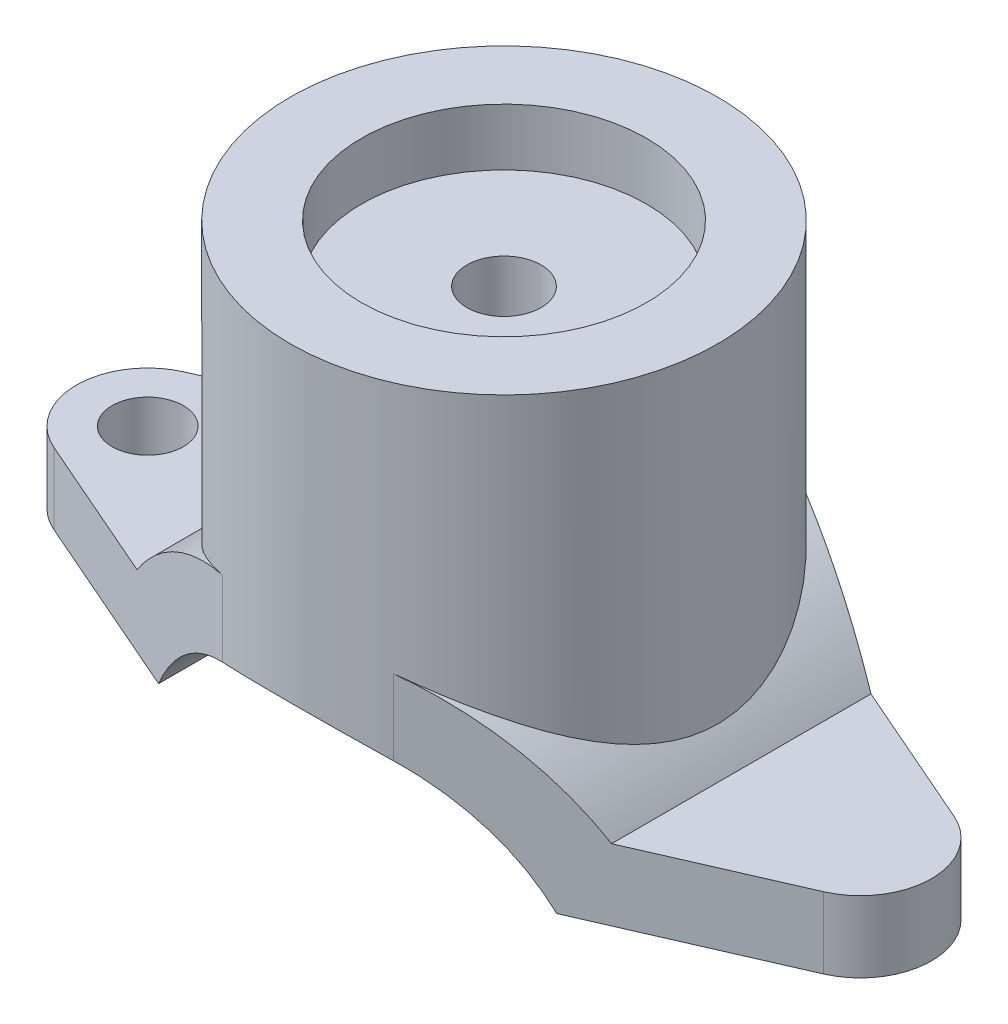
ISO-10303-21;
HEADER;
FILE_DESCRIPTION(('STEP AP214'),'2;1');
FILE_NAME('part.step','',(''),(''),'','','');
FILE_SCHEMA(('AUTOMOTIVE_DESIGN { 1 0 10303 214 1 1 1 1 }'));
ENDSEC;
DATA;
#1=APPLICATION_CONTEXT('core data for automotive mechanical design processes');
#2=APPLICATION_PROTOCOL_DEFINITION('international standard','automotive_design',2000,#1);
#3=PRODUCT_CONTEXT('',#1,'mechanical');
#4=PRODUCT('Part','Part','',(#3));
#5=PRODUCT_RELATED_PRODUCT_CATEGORY('part','',(#4));
#6=PRODUCT_DEFINITION_FORMATION('','',#4);
#7=PRODUCT_DEFINITION_CONTEXT('part definition',#1,'design');
#8=PRODUCT_DEFINITION('design','',#6,#7);
#9=PRODUCT_DEFINITION_SHAPE('','',#8);
#10=(LENGTH_UNIT() NAMED_UNIT(*) SI_UNIT(.MILLI.,.METRE.));
#11=(NAMED_UNIT(*) PLANE_ANGLE_UNIT() SI_UNIT($,.RADIAN.));
#12=(NAMED_UNIT(*) SI_UNIT($,.STERADIAN.) SOLID_ANGLE_UNIT());
#13=UNCERTAINTY_MEASURE_WITH_UNIT(LENGTH_MEASURE(1.E-05),#10,'distance_accuracy_value','');
#14=(GEOMETRIC_REPRESENTATION_CONTEXT(3) GLOBAL_UNCERTAINTY_ASSIGNED_CONTEXT((#13)) GLOBAL_UNIT_ASSIGNED_CONTEXT((#10,
#11,#12)) REPRESENTATION_CONTEXT('',''));
#15=CARTESIAN_POINT('',(0.,0.,0.));
#16=DIRECTION('',(0.,0.,1.));
#17=DIRECTION('',(1.,0.,0.));
#18=AXIS2_PLACEMENT_3D('',#15,#16,#17);
#19=CARTESIAN_POINT('',(150.,-39.,75.));
#20=DIRECTION('',(0.,0.,-1.));
#21=DIRECTION('',(-1.,0.,0.));
#22=AXIS2_PLACEMENT_3D('',#19,#20,#21);
#23=CYLINDRICAL_SURFACE('',#22,105.);
#24=CARTESIAN_POINT('',(150.,-39.,81.8317088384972));
#25=DIRECTION('',(-0.4,0.,0.916515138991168));
#26=DIRECTION('',(-0.916515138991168,0.,-0.4));
#27=AXIS2_PLACEMENT_3D('',#24,#25,#26);
#28=ELLIPSE('',#27,114.564392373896,105.);
#29=CARTESIAN_POINT('',(120.,61.6230589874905,68.7386354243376));
#30=VERTEX_POINT('',#29);
#31=CARTESIAN_POINT('',(66.759384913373,25.,45.502526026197));
#32=VERTEX_POINT('',#31);
#33=EDGE_CURVE('E62',#30,#32,#28,.T.);
#34=ORIENTED_EDGE('',*,*,#33,.F.);
#35=CARTESIAN_POINT('',(150.,66.,75.));
#36=CARTESIAN_POINT('',(150.927941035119,66.0000001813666,75.0000001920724));
#37=CARTESIAN_POINT('',(151.855877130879,65.9876926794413,74.9827726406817));
#38=CARTESIAN_POINT('',(153.709913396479,65.9385371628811,74.9139317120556));
#39=CARTESIAN_POINT('',(154.636013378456,65.9016867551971,74.8623149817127));
#40=CARTESIAN_POINT('',(156.484251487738,65.8036772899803,74.7249161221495));
#41=CARTESIAN_POINT('',(157.406390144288,65.7425215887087,74.6391387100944));
#42=CARTESIAN_POINT('',(159.245081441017,65.5962672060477,74.4337578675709));
#43=CARTESIAN_POINT('',(160.161633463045,65.5111659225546,74.3141507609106));
#44=CARTESIAN_POINT('',(161.987485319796,65.3175115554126,74.0415587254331));
#45=CARTESIAN_POINT('',(162.896783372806,65.2089528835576,73.8885658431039));
#46=CARTESIAN_POINT('',(164.706309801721,64.9690220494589,73.5497916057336));
#47=CARTESIAN_POINT('',(165.606537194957,64.8376474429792,73.3640067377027));
#48=CARTESIAN_POINT('',(167.396149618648,64.5528602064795,72.9603680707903));
#49=CARTESIAN_POINT('',(168.285535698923,64.3994497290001,72.7425174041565));
#50=CARTESIAN_POINT('',(170.052172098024,64.0714202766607,72.2754820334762));
#51=CARTESIAN_POINT('',(170.929421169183,63.8967991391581,72.0262941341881));
#52=CARTESIAN_POINT('',(172.665813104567,63.5282615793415,71.4988101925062));
#53=CARTESIAN_POINT('',(173.525026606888,63.3344507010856,71.2206729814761));
#54=CARTESIAN_POINT('',(175.228863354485,62.9277783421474,70.6350925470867));
#55=CARTESIAN_POINT('',(176.073485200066,62.7149150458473,70.3276465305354));
#56=CARTESIAN_POINT('',(178.583599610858,62.0493564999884,69.3627420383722));
#57=CARTESIAN_POINT('',(180.225800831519,61.5695941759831,68.6625768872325));
#58=CARTESIAN_POINT('',(183.439860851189,60.5470805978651,67.1559915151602));
#59=CARTESIAN_POINT('',(185.011720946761,60.004330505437,66.3495732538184));
#60=CARTESIAN_POINT('',(188.080059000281,58.8651483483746,64.6374173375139));
#61=CARTESIAN_POINT('',(189.576533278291,58.2687136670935,63.7316748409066));
#62=CARTESIAN_POINT('',(192.620552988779,56.9763615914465,61.7420809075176));
#63=CARTESIAN_POINT('',(194.160663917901,56.2763187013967,60.6495426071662));
#64=CARTESIAN_POINT('',(197.142794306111,54.8365537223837,58.3617111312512));
#65=CARTESIAN_POINT('',(198.584809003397,54.0968297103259,57.1664129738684));
#66=CARTESIAN_POINT('',(201.369817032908,52.5895876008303,54.6775530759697));
#67=CARTESIAN_POINT('',(202.712670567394,51.822032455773,53.3838576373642));
#68=CARTESIAN_POINT('',(205.294962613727,50.2733621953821,50.7043317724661));
#69=CARTESIAN_POINT('',(206.534395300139,49.4922463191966,49.3184961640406));
#70=CARTESIAN_POINT('',(208.423061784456,48.249375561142,47.0420640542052));
#71=CARTESIAN_POINT('',(209.10682488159,47.7873120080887,46.1800276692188));
#72=CARTESIAN_POINT('',(210.436662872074,46.8665455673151,44.4254607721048));
#73=CARTESIAN_POINT('',(211.082735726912,46.4078428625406,43.5329286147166));
#74=CARTESIAN_POINT('',(212.336626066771,45.4970162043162,41.7176498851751));
#75=CARTESIAN_POINT('',(212.944431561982,45.0448943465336,40.7948939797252));
#76=CARTESIAN_POINT('',(214.120695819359,44.1509590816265,38.9199315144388));
#77=CARTESIAN_POINT('',(214.689158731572,43.7091445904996,37.9677280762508));
#78=CARTESIAN_POINT('',(215.785217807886,42.840048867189,36.0352250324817));
#79=CARTESIAN_POINT('',(216.3128603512,42.4127514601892,35.0549590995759));
#80=CARTESIAN_POINT('',(217.326792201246,41.5762705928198,33.0658399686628));
#81=CARTESIAN_POINT('',(217.813080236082,41.1670876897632,32.0569858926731));
#82=CARTESIAN_POINT('',(219.207498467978,39.9735181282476,28.9890473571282));
#83=CARTESIAN_POINT('',(220.052075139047,39.2223926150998,26.8870194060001));
#84=CARTESIAN_POINT('',(221.315371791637,38.0687870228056,23.2705420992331));
#85=CARTESIAN_POINT('',(221.783752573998,37.631803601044,21.7841612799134));
#86=CARTESIAN_POINT('',(222.630920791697,36.8293459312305,18.7670670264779));
#87=CARTESIAN_POINT('',(223.009722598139,36.4638602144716,17.2363607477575));
#88=CARTESIAN_POINT('',(223.672026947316,35.8174238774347,14.1398142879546));
#89=CARTESIAN_POINT('',(223.955703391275,35.536319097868,12.5740438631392));
#90=CARTESIAN_POINT('',(224.424024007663,35.0687161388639,9.41360032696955));
#91=CARTESIAN_POINT('',(224.608668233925,34.8822179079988,7.81892723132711));
#92=CARTESIAN_POINT('',(224.876212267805,34.6110718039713,4.60164472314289));
#93=CARTESIAN_POINT('',(224.958432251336,34.5271045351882,2.97892037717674));
#94=CARTESIAN_POINT('',(225.017112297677,34.4672356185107,-0.270408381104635));
#95=CARTESIAN_POINT('',(224.993575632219,34.4913306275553,-1.89701267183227));
#96=CARTESIAN_POINT('',(224.841209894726,34.6464858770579,-5.1412433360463));
#97=CARTESIAN_POINT('',(224.712305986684,34.7776221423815,-6.7588625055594));
#98=CARTESIAN_POINT('',(224.351802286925,35.1409082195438,-9.97109938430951));
#99=CARTESIAN_POINT('',(224.120190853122,35.3730694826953,-11.5657144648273));
#100=CARTESIAN_POINT('',(223.522620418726,35.9641422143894,-14.9228139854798));
#101=CARTESIAN_POINT('',(223.143279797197,36.3354559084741,-16.6807238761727));
#102=CARTESIAN_POINT('',(222.266660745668,37.1767521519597,-20.1424915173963));
#103=CARTESIAN_POINT('',(221.769364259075,37.6467498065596,-21.8463409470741));
#104=CARTESIAN_POINT('',(220.663207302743,38.6677425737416,-25.1957951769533));
#105=CARTESIAN_POINT('',(220.054144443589,39.2188842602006,-26.8412877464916));
#106=CARTESIAN_POINT('',(218.731521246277,40.3835871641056,-30.066875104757));
#107=CARTESIAN_POINT('',(218.017951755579,40.9971538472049,-31.6469641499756));
#108=CARTESIAN_POINT('',(216.755103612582,42.050480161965,-34.2057275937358));
#109=CARTESIAN_POINT('',(216.234029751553,42.4772095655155,-35.2038906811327));
#110=CARTESIAN_POINT('',(215.150611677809,43.3460976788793,-37.1706628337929));
#111=CARTESIAN_POINT('',(214.588268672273,43.7882559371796,-38.1392727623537));
#112=CARTESIAN_POINT('',(213.423215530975,44.6841439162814,-40.0467868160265));
#113=CARTESIAN_POINT('',(212.820494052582,45.1378768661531,-40.985682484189));
#114=CARTESIAN_POINT('',(211.575705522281,46.0530966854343,-42.8330835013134));
#115=CARTESIAN_POINT('',(210.933639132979,46.5145834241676,-43.7415893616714));
#116=CARTESIAN_POINT('',(209.610346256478,47.4422355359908,-45.5284929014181));
#117=CARTESIAN_POINT('',(208.929088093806,47.9084044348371,-46.406865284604));
#118=CARTESIAN_POINT('',(207.528512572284,48.8417808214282,-48.1321597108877));
#119=CARTESIAN_POINT('',(206.809194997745,49.3089883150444,-48.9790815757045));
#120=CARTESIAN_POINT('',(205.333122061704,50.2412882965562,-50.6406992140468));
#121=CARTESIAN_POINT('',(204.576370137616,50.7063809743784,-51.4553979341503));
#122=CARTESIAN_POINT('',(203.025892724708,51.631504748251,-53.0517933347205));
#123=CARTESIAN_POINT('',(202.23216794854,52.0915359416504,-53.833490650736));
#124=CARTESIAN_POINT('',(200.600104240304,53.0082288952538,-55.3705565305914));
#125=CARTESIAN_POINT('',(199.761398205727,53.4648108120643,-56.1255831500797));
#126=CARTESIAN_POINT('',(198.047336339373,54.3669718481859,-57.5997502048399));
#127=CARTESIAN_POINT('',(197.171981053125,54.812551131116,-58.318891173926));
#128=CARTESIAN_POINT('',(195.385057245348,55.6899545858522,-59.7200628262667));
#129=CARTESIAN_POINT('',(194.473481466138,56.1217759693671,-60.4020860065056));
#130=CARTESIAN_POINT('',(192.61516176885,56.9686953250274,-61.7272234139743));
#131=CARTESIAN_POINT('',(191.668422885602,57.3837956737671,-62.3703431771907));
#132=CARTESIAN_POINT('',(189.742265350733,58.1938369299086,-63.614972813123));
#133=CARTESIAN_POINT('',(188.762907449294,58.588812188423,-64.2165542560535));
#134=CARTESIAN_POINT('',(186.771173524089,59.3565950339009,-65.3774371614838));
#135=CARTESIAN_POINT('',(185.758801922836,59.7294055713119,-65.9367442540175));
#136=CARTESIAN_POINT('',(183.70248905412,60.4501318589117,-67.0110991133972));
#137=CARTESIAN_POINT('',(182.65855522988,60.7980534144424,-67.5261572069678));
#138=CARTESIAN_POINT('',(180.540701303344,61.466406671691,-68.5100658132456));
#139=CARTESIAN_POINT('',(179.466783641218,61.7868406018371,-68.9789200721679));
#140=CARTESIAN_POINT('',(176.759249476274,62.5468848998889,-70.0856755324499));
#141=CARTESIAN_POINT('',(175.108376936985,62.9682924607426,-70.6943400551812));
#142=CARTESIAN_POINT('',(171.752462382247,63.7365236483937,-71.7979816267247));
#143=CARTESIAN_POINT('',(170.047429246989,64.0833594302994,-72.2929772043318));
#144=CARTESIAN_POINT('',(166.593534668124,64.6953623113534,-73.1629947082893));
#145=CARTESIAN_POINT('',(164.844697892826,64.9605743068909,-73.5380825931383));
#146=CARTESIAN_POINT('',(161.313819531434,65.40384675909,-74.163413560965));
#147=CARTESIAN_POINT('',(159.531777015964,65.5819047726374,-74.4136531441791));
#148=CARTESIAN_POINT('',(155.941776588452,65.8472459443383,-74.7861094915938));
#149=CARTESIAN_POINT('',(154.133753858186,65.934235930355,-74.9079127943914));
#150=CARTESIAN_POINT('',(150.511544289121,66.0143797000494,-75.0201406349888));
#151=CARTESIAN_POINT('',(148.697357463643,66.0075336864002,-75.0105654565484));
#152=CARTESIAN_POINT('',(145.077078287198,65.9001659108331,-74.8601866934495));
#153=CARTESIAN_POINT('',(143.27098670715,65.7996354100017,-74.7193708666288));
#154=CARTESIAN_POINT('',(139.681091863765,65.5072406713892,-74.3087082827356));
#155=CARTESIAN_POINT('',(137.897288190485,65.3153781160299,-74.0388639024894));
#156=CARTESIAN_POINT('',(134.4493575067,64.8559435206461,-73.3900996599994));
#157=CARTESIAN_POINT('',(132.783584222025,64.5924261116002,-73.017006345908));
#158=CARTESIAN_POINT('',(129.493876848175,63.9917215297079,-72.1622279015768));
#159=CARTESIAN_POINT('',(127.869941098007,63.6545372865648,-71.6805470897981));
#160=CARTESIAN_POINT('',(124.672111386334,62.9126722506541,-70.6140178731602));
#161=CARTESIAN_POINT('',(123.098221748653,62.5079856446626,-70.0291605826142));
#162=CARTESIAN_POINT('',(120.007418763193,61.6380800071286,-68.7621642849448));
#163=CARTESIAN_POINT('',(118.490508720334,61.172857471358,-68.0800196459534));
#164=CARTESIAN_POINT('',(115.384200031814,60.1446430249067,-66.5582676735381));
#165=CARTESIAN_POINT('',(113.800721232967,59.5766095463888,-65.7099875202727));
#166=CARTESIAN_POINT('',(110.713395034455,58.3873701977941,-63.9120837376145));
#167=CARTESIAN_POINT('',(109.209551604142,57.7661616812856,-62.9624550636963));
#168=CARTESIAN_POINT('',(106.284496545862,56.4804094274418,-60.9679451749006));
#169=CARTESIAN_POINT('',(104.8633368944,55.8158389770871,-59.9230050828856));
#170=CARTESIAN_POINT('',(102.107501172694,54.454113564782,-57.744216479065));
#171=CARTESIAN_POINT('',(100.772829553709,53.7569569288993,-56.6103633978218));
#172=CARTESIAN_POINT('',(97.9584730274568,52.2123928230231,-54.0456392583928));
#173=CARTESIAN_POINT('',(96.4962777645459,51.3606330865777,-52.5981580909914));
#174=CARTESIAN_POINT('',(93.6986410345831,49.6445180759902,-49.5920769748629));
#175=CARTESIAN_POINT('',(92.3632209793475,48.7801607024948,-48.0334583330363));
#176=CARTESIAN_POINT('',(89.8220295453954,47.0579387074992,-44.8087993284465));
#177=CARTESIAN_POINT('',(88.6163319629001,46.2000780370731,-43.1426986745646));
#178=CARTESIAN_POINT('',(86.3400386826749,44.5129646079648,-39.707109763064));
#179=CARTESIAN_POINT('',(85.2694191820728,43.6837068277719,-37.9376398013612));
#180=CARTESIAN_POINT('',(83.4245328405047,42.2027204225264,-34.5801213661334));
#181=CARTESIAN_POINT('',(82.630057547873,41.5434079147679,-33.006511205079));
#182=CARTESIAN_POINT('',(81.1468073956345,40.2791733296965,-29.7888506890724));
#183=CARTESIAN_POINT('',(80.4580315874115,39.674250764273,-28.1448009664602));
#184=CARTESIAN_POINT('',(79.1936296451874,38.5382449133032,-24.7923675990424));
#185=CARTESIAN_POINT('',(78.6178081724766,38.0070346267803,-23.0841012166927));
#186=CARTESIAN_POINT('',(77.5853601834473,37.0369825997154,-19.6063100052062));
#187=CARTESIAN_POINT('',(77.128704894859,36.5981185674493,-17.8368000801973));
#188=CARTESIAN_POINT('',(76.415706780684,35.903612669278,-14.580441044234));
#189=CARTESIAN_POINT('',(76.137898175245,35.6290704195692,-13.1023106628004));
#190=CARTESIAN_POINT('',(75.6704552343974,35.1635230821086,-10.1191423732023));
#191=CARTESIAN_POINT('',(75.4808099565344,34.9725076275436,-8.61410782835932));
#192=CARTESIAN_POINT('',(75.1930298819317,34.681472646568,-5.5879305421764));
#193=CARTESIAN_POINT('',(75.0948087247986,34.5813672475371,-4.06680437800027));
#194=CARTESIAN_POINT('',(74.9914015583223,34.4759537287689,-1.01804101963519));
#195=CARTESIAN_POINT('',(74.9862169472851,34.4706470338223,0.509596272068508));
#196=CARTESIAN_POINT('',(75.0689907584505,34.5550624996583,3.55971126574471));
#197=CARTESIAN_POINT('',(75.1569515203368,34.6447870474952,5.08218883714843));
#198=CARTESIAN_POINT('',(75.4243553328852,34.9155536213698,8.11076906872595));
#199=CARTESIAN_POINT('',(75.6037980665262,35.0965953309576,9.61687178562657));
#200=CARTESIAN_POINT('',(76.0513802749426,35.543284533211,12.6050518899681));
#201=CARTESIAN_POINT('',(76.3196366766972,35.8090435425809,14.0870948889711));
#202=CARTESIAN_POINT('',(76.9408033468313,36.4157930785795,17.0175918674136));
#203=CARTESIAN_POINT('',(77.2937253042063,36.7567939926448,18.4660411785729));
#204=CARTESIAN_POINT('',(78.2132131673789,37.6301765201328,21.8081059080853));
#205=CARTESIAN_POINT('',(78.8116515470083,38.1882562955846,23.6862870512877));
#206=CARTESIAN_POINT('',(80.1428377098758,39.3950458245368,27.3643143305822));
#207=CARTESIAN_POINT('',(80.8756329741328,40.0437875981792,29.1641324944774));
#208=CARTESIAN_POINT('',(82.4680796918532,41.4085850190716,32.6829299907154));
#209=CARTESIAN_POINT('',(83.3278909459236,42.124725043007,34.4018038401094));
#210=CARTESIAN_POINT('',(85.1670281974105,43.6019182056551,37.7536790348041));
#211=CARTESIAN_POINT('',(86.1463451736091,44.3629679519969,39.3866868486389));
#212=CARTESIAN_POINT('',(88.247546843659,45.9317344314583,42.6078754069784));
#213=CARTESIAN_POINT('',(89.3725555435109,46.7401556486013,44.1936722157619));
#214=CARTESIAN_POINT('',(91.7396388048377,48.3658513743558,47.2704719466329));
#215=CARTESIAN_POINT('',(92.9817135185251,49.1831258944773,48.7614747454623));
#216=CARTESIAN_POINT('',(95.5803202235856,50.8100753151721,51.6455951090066));
#217=CARTESIAN_POINT('',(96.9368884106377,51.6197477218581,53.0386814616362));
#218=CARTESIAN_POINT('',(99.7618204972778,53.2158157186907,55.7218042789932));
#219=CARTESIAN_POINT('',(101.230195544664,54.0022089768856,57.0118304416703));
#220=CARTESIAN_POINT('',(103.644655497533,55.2187915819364,58.9703438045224));
#221=CARTESIAN_POINT('',(104.555268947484,55.6616536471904,59.6750260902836));
#222=CARTESIAN_POINT('',(106.412975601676,56.5312655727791,61.0450903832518));
#223=CARTESIAN_POINT('',(107.360065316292,56.958016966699,61.7104761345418));
#224=CARTESIAN_POINT('',(109.290177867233,57.7926459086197,63.0004617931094));
#225=CARTESIAN_POINT('',(110.273212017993,58.2005174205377,63.6250486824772));
#226=CARTESIAN_POINT('',(112.273715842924,58.9943124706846,64.8312536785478));
#227=CARTESIAN_POINT('',(113.291180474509,59.3802392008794,65.4128780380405));
#228=CARTESIAN_POINT('',(115.358167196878,60.1269364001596,66.5306114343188));
#229=CARTESIAN_POINT('',(116.407651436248,60.4877350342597,67.0667715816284));
#230=CARTESIAN_POINT('',(118.538008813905,61.1818241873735,68.0921455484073));
#231=CARTESIAN_POINT('',(119.61887730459,61.5151187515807,68.5813662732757));
#232=CARTESIAN_POINT('',(121.809929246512,62.1514756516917,69.5106874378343));
#233=CARTESIAN_POINT('',(122.920105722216,62.4545451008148,69.9507994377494));
#234=CARTESIAN_POINT('',(125.167652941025,63.0279337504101,70.7798624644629));
#235=CARTESIAN_POINT('',(126.305021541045,63.298255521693,71.1688175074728));
#236=CARTESIAN_POINT('',(128.352420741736,63.748370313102,71.8141256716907));
#237=CARTESIAN_POINT('',(129.257689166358,63.9350242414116,72.0808639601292));
#238=CARTESIAN_POINT('',(131.081703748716,64.2858191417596,72.5809355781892));
#239=CARTESIAN_POINT('',(132.000449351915,64.4499610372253,72.8142702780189));
#240=CARTESIAN_POINT('',(133.849712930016,64.7547410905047,73.2466368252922));
#241=CARTESIAN_POINT('',(134.780229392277,64.8953822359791,73.4456730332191));
#242=CARTESIAN_POINT('',(136.651425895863,65.152327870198,73.8086976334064));
#243=CARTESIAN_POINT('',(137.592106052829,65.2686320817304,73.9726856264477));
#244=CARTESIAN_POINT('',(139.481003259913,65.4760868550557,74.2648186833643));
#245=CARTESIAN_POINT('',(140.429213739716,65.5672572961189,74.3929920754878));
#246=CARTESIAN_POINT('',(142.331933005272,65.7239798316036,74.6131216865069));
#247=CARTESIAN_POINT('',(143.286441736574,65.7895321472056,74.7050782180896));
#248=CARTESIAN_POINT('',(145.199723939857,65.8945912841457,74.8523743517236));
#249=CARTESIAN_POINT('',(146.158497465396,65.9340977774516,74.9077134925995));
#250=CARTESIAN_POINT('',(148.078182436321,65.9868019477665,74.9815260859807));
#251=CARTESIAN_POINT('',(149.039093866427,65.9999998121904,74.9999998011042));
#252=CARTESIAN_POINT('',(150.,66.,75.));
#253=B_SPLINE_CURVE_WITH_KNOTS('',3,(#35,#36,#37,#38,#39,#40,#41,#42,#43,#44,#45,#46,#47,#48,
#49,#50,#51,#52,#53,#54,#55,#56,#57,#58,#59,#60,#61,#62,#63,#64,#65,#66,#67,#68,#69,#70,#71,#72,
#73,#74,#75,#76,#77,#78,#79,#80,#81,#82,#83,#84,#85,#86,#87,#88,#89,#90,#91,#92,#93,#94,#95,#96,
#97,#98,#99,#100,#101,#102,#103,#104,#105,#106,#107,#108,#109,#110,#111,#112,#113,#114,#115,
#116,#117,#118,#119,#120,#121,#122,#123,#124,#125,#126,#127,#128,#129,#130,#131,#132,#133,#134,
#135,#136,#137,#138,#139,#140,#141,#142,#143,#144,#145,#146,#147,#148,#149,#150,#151,#152,#153,
#154,#155,#156,#157,#158,#159,#160,#161,#162,#163,#164,#165,#166,#167,#168,#169,#170,#171,#172,
#173,#174,#175,#176,#177,#178,#179,#180,#181,#182,#183,#184,#185,#186,#187,#188,#189,#190,#191,
#192,#193,#194,#195,#196,#197,#198,#199,#200,#201,#202,#203,#204,#205,#206,#207,#208,#209,#210,
#211,#212,#213,#214,#215,#216,#217,#218,#219,#220,#221,#222,#223,#224,#225,#226,#227,#228,#229,
#230,#231,#232,#233,#234,#235,#236,#237,#238,#239,#240,#241,#242,#243,#244,#245,#246,#247,#248,
#249,#250,#251,#252),.UNSPECIFIED.,.T.,.F.,(4,2,2,2,2,2,2,2,2,2,2,2,2,2,2,2,2,2,2,2,2,2,2,2,2,2,
2,2,2,2,2,2,2,2,2,2,2,2,2,2,2,2,2,2,2,2,2,2,2,2,2,2,2,2,2,2,2,2,2,2,2,2,2,2,2,2,2,2,2,2,2,2,2,2,
2,2,2,2,2,2,2,2,2,2,2,2,2,2,2,2,2,2,2,2,2,2,2,2,2,2,2,2,2,2,2,2,2,2,4),(0.,2.7835736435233,
5.56741873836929,8.35087955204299,11.1346429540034,13.9190702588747,16.7037960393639,
19.488249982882,22.2729880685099,25.0431813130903,27.8136388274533,33.353086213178,
38.8924314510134,44.4320468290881,50.4679235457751,56.5040930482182,62.5486160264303,
68.5934792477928,72.1727428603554,75.7521998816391,79.3327728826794,82.9129676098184,
86.489032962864,90.0652082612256,97.2117561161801,102.063453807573,106.914372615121,
111.75637435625,116.598373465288,121.472342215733,126.346160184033,131.223442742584,
136.10127829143,141.602168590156,147.103901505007,152.615697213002,158.12797592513,
161.739316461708,165.350551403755,168.962805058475,172.574997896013,176.190152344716,
179.805327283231,183.42017087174,187.034944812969,190.685908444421,194.336817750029,
197.988462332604,201.639586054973,205.284253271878,208.928434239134,212.571762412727,
216.214794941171,221.636596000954,227.057512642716,232.475442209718,237.893523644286,
243.32899418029,248.764452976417,254.200418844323,259.636284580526,264.812469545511,
269.988448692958,275.164873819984,280.341598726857,285.988253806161,291.635190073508,
297.285638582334,302.936377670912,309.610098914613,316.284945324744,322.963569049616,
329.641014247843,335.282598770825,340.924132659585,346.555822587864,352.18615150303,
356.768105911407,361.349491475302,365.926544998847,370.503667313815,375.080904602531,
379.658126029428,384.241397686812,388.825302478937,394.96219712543,401.101264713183,
407.248122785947,413.394517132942,419.706083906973,426.017658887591,432.331236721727,
438.645444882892,442.345334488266,446.044871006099,449.745582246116,453.44575381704,
457.141708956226,460.837119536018,464.531658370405,468.225906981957,471.111117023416,
473.996208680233,476.88093327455,479.76569072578,482.648159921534,485.530604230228,
488.413084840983,491.295544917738),.UNSPECIFIED.);
#254=CARTESIAN_POINT('',(120.,61.6230589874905,-68.7386354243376));
#255=VERTEX_POINT('',#254);
#256=EDGE_CURVE('E140',#255,#30,#253,.T.);
#257=ORIENTED_EDGE('',*,*,#256,.F.);
#258=CARTESIAN_POINT('',(150.,-39.,-81.8317088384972));
#259=DIRECTION('',(-0.4,0.,-0.916515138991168));
#260=DIRECTION('',(0.916515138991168,0.,-0.4));
#261=AXIS2_PLACEMENT_3D('',#258,#259,#260);
#262=ELLIPSE('',#261,114.564392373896,105.);
#263=CARTESIAN_POINT('',(66.759384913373,25.,-45.502526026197));
#264=VERTEX_POINT('',#263);
#265=EDGE_CURVE('E229',#264,#255,#262,.T.);
#266=ORIENTED_EDGE('',*,*,#265,.F.);
#267=DIRECTION('',(0.,0.,-1.));
#268=VECTOR('',#267,1.);
#269=CARTESIAN_POINT('',(66.759384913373,25.,75.));
#270=LINE('',#269,#268);
#271=EDGE_CURVE('E227',#32,#264,#270,.T.);
#272=ORIENTED_EDGE('',*,*,#271,.F.);
#273=EDGE_LOOP('',(#34,#257,#266,#272));
#274=FACE_BOUND('',#273,.T.);
#275=ADVANCED_FACE('F34',(#274),#23,.T.);
#276=CARTESIAN_POINT('',(0.,25.,75.));
#277=DIRECTION('',(0.,-1.,0.));
#278=DIRECTION('',(0.,0.,-1.));
#279=AXIS2_PLACEMENT_3D('',#276,#277,#278);
#280=PLANE('',#279);
#281=CARTESIAN_POINT('',(25.,25.,0.));
#282=DIRECTION('',(0.,1.,0.));
#283=DIRECTION('',(0.,0.,1.));
#284=AXIS2_PLACEMENT_3D('',#281,#282,#283);
#285=CIRCLE('',#284,12.5);
#286=CARTESIAN_POINT('',(25.,25.,12.5));
#287=VERTEX_POINT('',#286);
#288=EDGE_CURVE('E333',#287,#287,#285,.T.);
#289=ORIENTED_EDGE('',*,*,#288,.F.);
#290=EDGE_LOOP('',(#289));
#291=FACE_BOUND('',#290,.T.);
#292=DIRECTION('',(0.916515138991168,0.,-0.4));
#293=VECTOR('',#292,1.);
#294=CARTESIAN_POINT('',(-33.4954541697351,25.,-1.74772708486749));
#295=LINE('',#294,#293);
#296=CARTESIAN_POINT('',(15.,25.,-22.9128784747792));
#297=VERTEX_POINT('',#296);
#298=EDGE_CURVE('E147',#297,#264,#295,.T.);
#299=ORIENTED_EDGE('',*,*,#298,.F.);
#300=CARTESIAN_POINT('',(25.,25.,0.));
#301=DIRECTION('',(0.,-1.,0.));
#302=DIRECTION('',(0.,0.,-1.));
#303=AXIS2_PLACEMENT_3D('',#300,#301,#302);
#304=CIRCLE('',#303,25.);
#305=CARTESIAN_POINT('',(15.,25.,22.9128784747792));
#306=VERTEX_POINT('',#305);
#307=EDGE_CURVE('E253',#306,#297,#304,.T.);
#308=ORIENTED_EDGE('',*,*,#307,.F.);
#309=DIRECTION('',(-0.916515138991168,0.,-0.4));
#310=VECTOR('',#309,1.);
#311=CARTESIAN_POINT('',(21.4954541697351,25.,25.7477270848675));
#312=LINE('',#311,#310);
#313=EDGE_CURVE('E251',#32,#306,#312,.T.);
#314=ORIENTED_EDGE('',*,*,#313,.F.);
#315=ORIENTED_EDGE('',*,*,#271,.T.);
#316=EDGE_LOOP('',(#299,#308,#314,#315));
#317=FACE_BOUND('',#316,.T.);
#318=ADVANCED_FACE('F196',(#291,#317),#280,.F.);
#319=CARTESIAN_POINT('',(150.,-39.,-81.8317088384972));
#320=DIRECTION('',(0.400000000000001,0.,-0.916515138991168));
#321=DIRECTION('',(-0.916515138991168,0.,-0.400000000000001));
#322=AXIS2_PLACEMENT_3D('',#319,#320,#321);
#323=ELLIPSE('',#322,114.564392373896,105.);
#324=CARTESIAN_POINT('',(180.,61.6230589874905,-68.7386354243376));
#325=VERTEX_POINT('',#324);
#326=CARTESIAN_POINT('',(233.240615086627,25.,-45.502526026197));
#327=VERTEX_POINT('',#326);
#328=EDGE_CURVE('E47',#325,#327,#323,.T.);
#329=ORIENTED_EDGE('',*,*,#328,.F.);
#330=CARTESIAN_POINT('',(180.,61.6230589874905,68.7386354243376));
#331=VERTEX_POINT('',#330);
#332=EDGE_CURVE('E129',#331,#325,#253,.T.);
#333=ORIENTED_EDGE('',*,*,#332,.F.);
#334=CARTESIAN_POINT('',(150.,-39.,81.8317088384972));
#335=DIRECTION('',(0.4,0.,0.916515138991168));
#336=DIRECTION('',(0.916515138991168,0.,-0.4));
#337=AXIS2_PLACEMENT_3D('',#334,#335,#336);
#338=ELLIPSE('',#337,114.564392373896,105.);
#339=CARTESIAN_POINT('',(233.240615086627,25.,45.5025260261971));
#340=VERTEX_POINT('',#339);
#341=EDGE_CURVE('E133',#340,#331,#338,.T.);
#342=ORIENTED_EDGE('',*,*,#341,.F.);
#343=DIRECTION('',(0.,0.,-1.));
#344=VECTOR('',#343,1.);
#345=CARTESIAN_POINT('',(233.240615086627,25.,75.));
#346=LINE('',#345,#344);
#347=EDGE_CURVE('E243',#340,#327,#346,.T.);
#348=ORIENTED_EDGE('',*,*,#347,.T.);
#349=EDGE_LOOP('',(#329,#333,#342,#348));
#350=FACE_BOUND('',#349,.T.);
#351=ADVANCED_FACE('F131',(#350),#23,.T.);
#352=CARTESIAN_POINT('',(233.240615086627,25.,75.));
#353=DIRECTION('',(0.,-1.,0.));
#354=DIRECTION('',(1.,0.,0.));
#355=AXIS2_PLACEMENT_3D('',#352,#353,#354);
#356=PLANE('',#355);
#357=DIRECTION('',(0.916515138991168,0.,0.400000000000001));
#358=VECTOR('',#357,1.);
#359=CARTESIAN_POINT('',(277.417570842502,25.,-26.2221218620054));
#360=LINE('',#359,#358);
#361=CARTESIAN_POINT('',(285.,25.,-22.9128784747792));
#362=VERTEX_POINT('',#361);
#363=EDGE_CURVE('E237',#327,#362,#360,.T.);
#364=ORIENTED_EDGE('',*,*,#363,.F.);
#365=ORIENTED_EDGE('',*,*,#347,.F.);
#366=DIRECTION('',(-0.916515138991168,0.,0.4));
#367=VECTOR('',#366,1.);
#368=CARTESIAN_POINT('',(222.426662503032,25.,50.2221218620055));
#369=LINE('',#368,#367);
#370=CARTESIAN_POINT('',(285.,25.,22.9128784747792));
#371=VERTEX_POINT('',#370);
#372=EDGE_CURVE('E146',#371,#340,#369,.T.);
#373=ORIENTED_EDGE('',*,*,#372,.F.);
#374=CARTESIAN_POINT('',(275.,25.,0.));
#375=DIRECTION('',(0.,-1.,0.));
#376=DIRECTION('',(1.,0.,0.));
#377=AXIS2_PLACEMENT_3D('',#374,#375,#376);
#378=CIRCLE('',#377,25.);
#379=EDGE_CURVE('E12',#362,#371,#378,.T.);
#380=ORIENTED_EDGE('',*,*,#379,.F.);
#381=EDGE_LOOP('',(#364,#365,#373,#380));
#382=FACE_BOUND('',#381,.T.);
#383=ADVANCED_FACE('F202',(#382),#356,.F.);
#384=CARTESIAN_POINT('',(275.,0.,0.));
#385=DIRECTION('',(0.,1.,0.));
#386=DIRECTION('',(0.,0.,1.));
#387=AXIS2_PLACEMENT_3D('',#384,#385,#386);
#388=CYLINDRICAL_SURFACE('',#387,25.);
#389=CARTESIAN_POINT('',(275.,0.,0.));
#390=DIRECTION('',(0.,1.,0.));
#391=DIRECTION('',(0.,0.,1.));
#392=AXIS2_PLACEMENT_3D('',#389,#390,#391);
#393=CIRCLE('',#392,25.);
#394=CARTESIAN_POINT('',(285.,0.,22.9128784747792));
#395=VERTEX_POINT('',#394);
#396=CARTESIAN_POINT('',(285.,0.,-22.9128784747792));
#397=VERTEX_POINT('',#396);
#398=EDGE_CURVE('E267',#395,#397,#393,.T.);
#399=ORIENTED_EDGE('',*,*,#398,.T.);
#400=DIRECTION('',(0.,1.,0.));
#401=VECTOR('',#400,1.);
#402=CARTESIAN_POINT('',(285.,0.,-22.9128784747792));
#403=LINE('',#402,#401);
#404=EDGE_CURVE('E157',#397,#362,#403,.T.);
#405=ORIENTED_EDGE('',*,*,#404,.T.);
#406=ORIENTED_EDGE('',*,*,#379,.T.);
#407=DIRECTION('',(0.,1.,0.));
#408=VECTOR('',#407,1.);
#409=CARTESIAN_POINT('',(285.,0.,22.9128784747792));
#410=LINE('',#409,#408);
#411=EDGE_CURVE('E154',#395,#371,#410,.T.);
#412=ORIENTED_EDGE('',*,*,#411,.F.);
#413=EDGE_LOOP('',(#399,#405,#406,#412));
#414=FACE_BOUND('',#413,.T.);
#415=ADVANCED_FACE('F204',(#414),#388,.T.);
#416=CARTESIAN_POINT('',(180.,0.,-68.7386354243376));
#417=DIRECTION('',(0.400000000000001,0.,-0.916515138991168));
#418=DIRECTION('',(-0.916515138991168,0.,-0.400000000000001));
#419=AXIS2_PLACEMENT_3D('',#416,#417,#418);
#420=PLANE('',#419);
#421=CARTESIAN_POINT('',(150.,-39.,-81.8317088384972));
#422=DIRECTION('',(0.400000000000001,0.,-0.916515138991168));
#423=DIRECTION('',(-0.916515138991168,0.,-0.400000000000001));
#424=AXIS2_PLACEMENT_3D('',#421,#422,#423);
#425=ELLIPSE('',#424,87.2871560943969,80.);
#426=CARTESIAN_POINT('',(219.849838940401,0.,-51.3467398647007));
#427=VERTEX_POINT('',#426);
#428=CARTESIAN_POINT('',(180.,35.1619848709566,-68.7386354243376));
#429=VERTEX_POINT('',#428);
#430=EDGE_CURVE('E240',#427,#429,#425,.F.);
#431=ORIENTED_EDGE('',*,*,#430,.T.);
#432=DIRECTION('',(0.,1.,0.));
#433=VECTOR('',#432,1.);
#434=CARTESIAN_POINT('',(180.,0.,-68.7386354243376));
#435=LINE('',#434,#433);
#436=EDGE_CURVE('E261',#429,#325,#435,.T.);
#437=ORIENTED_EDGE('',*,*,#436,.T.);
#438=ORIENTED_EDGE('',*,*,#328,.T.);
#439=ORIENTED_EDGE('',*,*,#363,.T.);
#440=ORIENTED_EDGE('',*,*,#404,.F.);
#441=DIRECTION('',(-0.916515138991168,0.,-0.400000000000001));
#442=VECTOR('',#441,1.);
#443=CARTESIAN_POINT('',(180.,0.,-68.7386354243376));
#444=LINE('',#443,#442);
#445=EDGE_CURVE('E270',#397,#427,#444,.T.);
#446=ORIENTED_EDGE('',*,*,#445,.T.);
#447=EDGE_LOOP('',(#431,#437,#438,#439,#440,#446));
#448=FACE_BOUND('',#447,.T.);
#449=ADVANCED_FACE('F258',(#448),#420,.T.);
#450=CARTESIAN_POINT('',(180.,0.,68.7386354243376));
#451=DIRECTION('',(0.4,0.,0.916515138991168));
#452=DIRECTION('',(0.916515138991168,0.,-0.4));
#453=AXIS2_PLACEMENT_3D('',#450,#451,#452);
#454=PLANE('',#453);
#455=CARTESIAN_POINT('',(150.,-39.,81.8317088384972));
#456=DIRECTION('',(0.4,0.,0.916515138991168));
#457=DIRECTION('',(0.916515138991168,0.,-0.4));
#458=AXIS2_PLACEMENT_3D('',#455,#456,#457);
#459=ELLIPSE('',#458,87.2871560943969,80.);
#460=CARTESIAN_POINT('',(180.,35.1619848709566,68.7386354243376));
#461=VERTEX_POINT('',#460);
#462=CARTESIAN_POINT('',(219.849838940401,0.,51.3467398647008));
#463=VERTEX_POINT('',#462);
#464=EDGE_CURVE('E54',#461,#463,#459,.F.);
#465=ORIENTED_EDGE('',*,*,#464,.T.);
#466=DIRECTION('',(0.916515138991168,0.,-0.4));
#467=VECTOR('',#466,1.);
#468=CARTESIAN_POINT('',(180.,0.,68.7386354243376));
#469=LINE('',#468,#467);
#470=EDGE_CURVE('E265',#463,#395,#469,.T.);
#471=ORIENTED_EDGE('',*,*,#470,.T.);
#472=ORIENTED_EDGE('',*,*,#411,.T.);
#473=ORIENTED_EDGE('',*,*,#372,.T.);
#474=ORIENTED_EDGE('',*,*,#341,.T.);
#475=DIRECTION('',(0.,1.,0.));
#476=VECTOR('',#475,1.);
#477=CARTESIAN_POINT('',(180.,0.,68.7386354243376));
#478=LINE('',#477,#476);
#479=EDGE_CURVE('E143',#461,#331,#478,.T.);
#480=ORIENTED_EDGE('',*,*,#479,.F.);
#481=EDGE_LOOP('',(#465,#471,#472,#473,#474,#480));
#482=FACE_BOUND('',#481,.T.);
#483=ADVANCED_FACE('F142',(#482),#454,.T.);
#484=CARTESIAN_POINT('',(25.,0.,0.));
#485=DIRECTION('',(0.,1.,0.));
#486=DIRECTION('',(0.,0.,1.));
#487=AXIS2_PLACEMENT_3D('',#484,#485,#486);
#488=CYLINDRICAL_SURFACE('',#487,25.);
#489=DIRECTION('',(0.,1.,0.));
#490=VECTOR('',#489,1.);
#491=CARTESIAN_POINT('',(15.,0.,-22.9128784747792));
#492=LINE('',#491,#490);
#493=CARTESIAN_POINT('',(15.,0.,-22.9128784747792));
#494=VERTEX_POINT('',#493);
#495=EDGE_CURVE('E173',#494,#297,#492,.T.);
#496=ORIENTED_EDGE('',*,*,#495,.F.);
#497=CARTESIAN_POINT('',(25.,0.,0.));
#498=DIRECTION('',(0.,1.,0.));
#499=DIRECTION('',(0.,0.,1.));
#500=AXIS2_PLACEMENT_3D('',#497,#498,#499);
#501=CIRCLE('',#500,25.);
#502=CARTESIAN_POINT('',(15.,0.,22.9128784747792));
#503=VERTEX_POINT('',#502);
#504=EDGE_CURVE('E139',#494,#503,#501,.T.);
#505=ORIENTED_EDGE('',*,*,#504,.T.);
#506=DIRECTION('',(0.,1.,0.));
#507=VECTOR('',#506,1.);
#508=CARTESIAN_POINT('',(15.,0.,22.9128784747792));
#509=LINE('',#508,#507);
#510=EDGE_CURVE('E159',#503,#306,#509,.T.);
#511=ORIENTED_EDGE('',*,*,#510,.T.);
#512=ORIENTED_EDGE('',*,*,#307,.T.);
#513=EDGE_LOOP('',(#496,#505,#511,#512));
#514=FACE_BOUND('',#513,.T.);
#515=ADVANCED_FACE('F192',(#514),#488,.T.);
#516=CARTESIAN_POINT('',(15.,0.,-22.9128784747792));
#517=DIRECTION('',(-0.4,0.,-0.916515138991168));
#518=DIRECTION('',(-0.916515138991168,0.,0.4));
#519=AXIS2_PLACEMENT_3D('',#516,#517,#518);
#520=PLANE('',#519);
#521=CARTESIAN_POINT('',(150.,-39.,-81.8317088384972));
#522=DIRECTION('',(-0.4,0.,-0.916515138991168));
#523=DIRECTION('',(0.916515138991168,0.,-0.4));
#524=AXIS2_PLACEMENT_3D('',#521,#522,#523);
#525=ELLIPSE('',#524,87.2871560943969,80.);
#526=CARTESIAN_POINT('',(120.,35.1619848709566,-68.7386354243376));
#527=VERTEX_POINT('',#526);
#528=CARTESIAN_POINT('',(80.1501610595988,0.,-51.3467398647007));
#529=VERTEX_POINT('',#528);
#530=EDGE_CURVE('E233',#527,#529,#525,.F.);
#531=ORIENTED_EDGE('',*,*,#530,.T.);
#532=DIRECTION('',(-0.916515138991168,0.,0.4));
#533=VECTOR('',#532,1.);
#534=CARTESIAN_POINT('',(15.,0.,-22.9128784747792));
#535=LINE('',#534,#533);
#536=EDGE_CURVE('E165',#529,#494,#535,.T.);
#537=ORIENTED_EDGE('',*,*,#536,.T.);
#538=ORIENTED_EDGE('',*,*,#495,.T.);
#539=ORIENTED_EDGE('',*,*,#298,.T.);
#540=ORIENTED_EDGE('',*,*,#265,.T.);
#541=DIRECTION('',(0.,1.,0.));
#542=VECTOR('',#541,1.);
#543=CARTESIAN_POINT('',(120.,0.,-68.7386354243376));
#544=LINE('',#543,#542);
#545=EDGE_CURVE('E280',#527,#255,#544,.T.);
#546=ORIENTED_EDGE('',*,*,#545,.F.);
#547=EDGE_LOOP('',(#531,#537,#538,#539,#540,#546));
#548=FACE_BOUND('',#547,.T.);
#549=ADVANCED_FACE('F191',(#548),#520,.T.);
#550=CARTESIAN_POINT('',(15.,0.,22.9128784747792));
#551=DIRECTION('',(-0.4,0.,0.916515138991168));
#552=DIRECTION('',(0.916515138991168,0.,0.4));
#553=AXIS2_PLACEMENT_3D('',#550,#551,#552);
#554=PLANE('',#553);
#555=CARTESIAN_POINT('',(150.,-39.,81.8317088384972));
#556=DIRECTION('',(-0.4,0.,0.916515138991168));
#557=DIRECTION('',(-0.916515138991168,0.,-0.4));
#558=AXIS2_PLACEMENT_3D('',#555,#556,#557);
#559=ELLIPSE('',#558,87.2871560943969,80.);
#560=CARTESIAN_POINT('',(80.1501610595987,0.,51.3467398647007));
#561=VERTEX_POINT('',#560);
#562=CARTESIAN_POINT('',(120.,35.1619848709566,68.7386354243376));
#563=VERTEX_POINT('',#562);
#564=EDGE_CURVE('E228',#561,#563,#559,.F.);
#565=ORIENTED_EDGE('',*,*,#564,.T.);
#566=DIRECTION('',(0.,1.,0.));
#567=VECTOR('',#566,1.);
#568=CARTESIAN_POINT('',(120.,0.,68.7386354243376));
#569=LINE('',#568,#567);
#570=EDGE_CURVE('E155',#563,#30,#569,.T.);
#571=ORIENTED_EDGE('',*,*,#570,.T.);
#572=ORIENTED_EDGE('',*,*,#33,.T.);
#573=ORIENTED_EDGE('',*,*,#313,.T.);
#574=ORIENTED_EDGE('',*,*,#510,.F.);
#575=DIRECTION('',(0.916515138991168,0.,0.4));
#576=VECTOR('',#575,1.);
#577=CARTESIAN_POINT('',(15.,0.,22.9128784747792));
#578=LINE('',#577,#576);
#579=EDGE_CURVE('E268',#503,#561,#578,.T.);
#580=ORIENTED_EDGE('',*,*,#579,.T.);
#581=EDGE_LOOP('',(#565,#571,#572,#573,#574,#580));
#582=FACE_BOUND('',#581,.T.);
#583=ADVANCED_FACE('F186',(#582),#554,.T.);
#584=CARTESIAN_POINT('',(150.,0.,0.));
#585=DIRECTION('',(0.,1.,0.));
#586=DIRECTION('',(0.,0.,1.));
#587=AXIS2_PLACEMENT_3D('',#584,#585,#586);
#588=CYLINDRICAL_SURFACE('',#587,75.);
#589=CARTESIAN_POINT('',(120.,35.1619848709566,68.7386354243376));
#590=CARTESIAN_POINT('',(120.69965477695,35.4450166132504,69.0439963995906));
#591=CARTESIAN_POINT('',(121.406880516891,35.7195746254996,69.3399312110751));
#592=CARTESIAN_POINT('',(122.835920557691,36.2508716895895,69.9121235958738));
#593=CARTESIAN_POINT('',(123.557736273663,36.5076090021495,70.1883792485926));
#594=CARTESIAN_POINT('',(125.015781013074,37.002512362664,70.7205164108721));
#595=CARTESIAN_POINT('',(125.75201985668,37.2406651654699,70.976383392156));
#596=CARTESIAN_POINT('',(127.237552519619,37.6972951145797,71.4666567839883));
#597=CARTESIAN_POINT('',(127.986845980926,37.9157727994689,71.7010637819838));
#598=CARTESIAN_POINT('',(130.256291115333,38.5412811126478,72.371793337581));
#599=CARTESIAN_POINT('',(131.795215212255,38.9174344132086,72.774600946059));
#600=CARTESIAN_POINT('',(134.913348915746,39.5807454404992,73.4843485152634));
#601=CARTESIAN_POINT('',(136.49254870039,39.867924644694,73.7913116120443));
#602=CARTESIAN_POINT('',(139.688658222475,40.349220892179,74.3054984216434));
#603=CARTESIAN_POINT('',(141.305704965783,40.5429162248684,74.5122701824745));
#604=CARTESIAN_POINT('',(144.55875449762,40.8314433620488,74.8201994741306));
#605=CARTESIAN_POINT('',(146.19475874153,40.9262675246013,74.9213488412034));
#606=CARTESIAN_POINT('',(149.469902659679,41.0149868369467,75.0159875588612));
#607=CARTESIAN_POINT('',(151.109032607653,41.0090494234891,75.0096555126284));
#608=CARTESIAN_POINT('',(154.379789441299,40.8967754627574,74.8898869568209));
#609=CARTESIAN_POINT('',(156.011416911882,40.7904468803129,74.7764589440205));
#610=CARTESIAN_POINT('',(159.167618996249,40.4879395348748,74.4535795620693));
#611=CARTESIAN_POINT('',(160.693251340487,40.2968713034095,74.2495892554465));
#612=CARTESIAN_POINT('',(163.716554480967,39.8301705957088,73.7509559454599));
#613=CARTESIAN_POINT('',(165.214223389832,39.5545324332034,73.4563068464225));
#614=CARTESIAN_POINT('',(168.172842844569,38.9232736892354,72.7808423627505));
#615=CARTESIAN_POINT('',(169.633789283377,38.5676442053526,72.4000173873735));
#616=CARTESIAN_POINT('',(172.511150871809,37.78197199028,71.5576292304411));
#617=CARTESIAN_POINT('',(173.927581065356,37.3519547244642,71.0960936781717));
#618=CARTESIAN_POINT('',(176.116988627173,36.6215008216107,70.3108980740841));
#619=CARTESIAN_POINT('',(176.906837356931,36.3439811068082,70.0123474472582));
#620=CARTESIAN_POINT('',(178.467399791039,35.7682897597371,69.392436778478));
#621=CARTESIAN_POINT('',(179.2381554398,35.4701701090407,69.071134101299));
#622=CARTESIAN_POINT('',(180.,35.1619848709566,68.7386354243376));
#623=B_SPLINE_CURVE_WITH_KNOTS('',3,(#589,#590,#591,#592,#593,#594,#595,#596,#597,#598,#599,
#600,#601,#602,#603,#604,#605,#606,#607,#608,#609,#610,#611,#612,#613,#614,#615,#616,#617,#618,
#619,#620,#621,#622),.UNSPECIFIED.,.F.,.F.,(4,2,2,2,2,2,2,2,2,2,2,2,2,2,2,2,4),(0.,
2.44240296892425,4.88504397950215,7.32941025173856,9.77370959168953,14.6716503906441,
19.5684079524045,24.4870532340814,29.4060786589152,34.3169308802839,39.2273935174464,
43.8751848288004,48.5232887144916,53.1719101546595,57.8189433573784,60.4847624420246,
63.1440843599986),.UNSPECIFIED.);
#624=EDGE_CURVE('E153',#563,#461,#623,.T.);
#625=ORIENTED_EDGE('',*,*,#624,.T.);
#626=ORIENTED_EDGE('',*,*,#479,.T.);
#627=ORIENTED_EDGE('',*,*,#332,.T.);
#628=ORIENTED_EDGE('',*,*,#436,.F.);
#629=CARTESIAN_POINT('',(180.,35.1619848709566,-68.7386354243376));
#630=CARTESIAN_POINT('',(179.30034522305,35.4450166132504,-69.0439963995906));
#631=CARTESIAN_POINT('',(178.593119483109,35.7195746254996,-69.3399312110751));
#632=CARTESIAN_POINT('',(177.164079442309,36.2508716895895,-69.9121235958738));
#633=CARTESIAN_POINT('',(176.442263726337,36.5076090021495,-70.1883792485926));
#634=CARTESIAN_POINT('',(174.984218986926,37.002512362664,-70.7205164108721));
#635=CARTESIAN_POINT('',(174.24798014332,37.2406651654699,-70.976383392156));
#636=CARTESIAN_POINT('',(172.762447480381,37.6972951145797,-71.4666567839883));
#637=CARTESIAN_POINT('',(172.013154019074,37.9157727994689,-71.7010637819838));
#638=CARTESIAN_POINT('',(169.743708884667,38.5412811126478,-72.371793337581));
#639=CARTESIAN_POINT('',(168.204784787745,38.9174344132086,-72.774600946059));
#640=CARTESIAN_POINT('',(165.086651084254,39.5807454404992,-73.4843485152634));
#641=CARTESIAN_POINT('',(163.50745129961,39.867924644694,-73.7913116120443));
#642=CARTESIAN_POINT('',(160.311341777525,40.349220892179,-74.3054984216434));
#643=CARTESIAN_POINT('',(158.694295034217,40.5429162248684,-74.5122701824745));
#644=CARTESIAN_POINT('',(155.44124550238,40.8314433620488,-74.8201994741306));
#645=CARTESIAN_POINT('',(153.80524125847,40.9262675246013,-74.9213488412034));
#646=CARTESIAN_POINT('',(150.530097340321,41.0149868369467,-75.0159875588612));
#647=CARTESIAN_POINT('',(148.890967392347,41.0090494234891,-75.0096555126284));
#648=CARTESIAN_POINT('',(145.620210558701,40.8967754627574,-74.8898869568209));
#649=CARTESIAN_POINT('',(143.988583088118,40.7904468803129,-74.7764589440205));
#650=CARTESIAN_POINT('',(140.832381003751,40.4879395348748,-74.4535795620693));
#651=CARTESIAN_POINT('',(139.306748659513,40.2968713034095,-74.2495892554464));
#652=CARTESIAN_POINT('',(136.283445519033,39.8301705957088,-73.7509559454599));
#653=CARTESIAN_POINT('',(134.785776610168,39.5545324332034,-73.4563068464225));
#654=CARTESIAN_POINT('',(131.827157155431,38.9232736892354,-72.7808423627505));
#655=CARTESIAN_POINT('',(130.366210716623,38.5676442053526,-72.4000173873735));
#656=CARTESIAN_POINT('',(127.488849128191,37.78197199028,-71.5576292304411));
#657=CARTESIAN_POINT('',(126.072418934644,37.3519547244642,-71.0960936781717));
#658=CARTESIAN_POINT('',(123.883011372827,36.6215008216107,-70.3108980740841));
#659=CARTESIAN_POINT('',(123.093162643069,36.3439811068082,-70.0123474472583));
#660=CARTESIAN_POINT('',(121.532600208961,35.7682897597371,-69.392436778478));
#661=CARTESIAN_POINT('',(120.7618445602,35.4701701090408,-69.071134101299));
#662=CARTESIAN_POINT('',(120.,35.1619848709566,-68.7386354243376));
#663=B_SPLINE_CURVE_WITH_KNOTS('',3,(#629,#630,#631,#632,#633,#634,#635,#636,#637,#638,#639,
#640,#641,#642,#643,#644,#645,#646,#647,#648,#649,#650,#651,#652,#653,#654,#655,#656,#657,#658,
#659,#660,#661,#662),.UNSPECIFIED.,.F.,.F.,(4,2,2,2,2,2,2,2,2,2,2,2,2,2,2,2,4),(0.,
2.44240296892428,4.88504397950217,7.32941025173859,9.77370959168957,14.6716503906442,
19.5684079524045,24.4870532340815,29.4060786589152,34.3169308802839,39.2273935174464,
43.8751848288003,48.5232887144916,53.1719101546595,57.8189433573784,60.4847624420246,
63.1440843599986),.UNSPECIFIED.);
#664=EDGE_CURVE('E166',#429,#527,#663,.T.);
#665=ORIENTED_EDGE('',*,*,#664,.T.);
#666=ORIENTED_EDGE('',*,*,#545,.T.);
#667=ORIENTED_EDGE('',*,*,#256,.T.);
#668=ORIENTED_EDGE('',*,*,#570,.F.);
#669=EDGE_LOOP('',(#625,#626,#627,#628,#665,#666,#667,#668));
#670=FACE_BOUND('',#669,.T.);
#671=CARTESIAN_POINT('',(150.,150.,0.));
#672=DIRECTION('',(0.,1.,0.));
#673=DIRECTION('',(0.,0.,1.));
#674=AXIS2_PLACEMENT_3D('',#671,#672,#673);
#675=CIRCLE('',#674,75.);
#676=CARTESIAN_POINT('',(150.,150.,75.));
#677=VERTEX_POINT('',#676);
#678=EDGE_CURVE('E305',#677,#677,#675,.T.);
#679=ORIENTED_EDGE('',*,*,#678,.F.);
#680=EDGE_LOOP('',(#679));
#681=FACE_BOUND('',#680,.T.);
#682=ADVANCED_FACE('F149',(#670,#681),#588,.T.);
#683=CARTESIAN_POINT('',(0.,0.,75.));
#684=DIRECTION('',(0.,1.,0.));
#685=DIRECTION('',(0.,0.,1.));
#686=AXIS2_PLACEMENT_3D('',#683,#684,#685);
#687=PLANE('',#686);
#688=CARTESIAN_POINT('',(25.,0.,0.));
#689=DIRECTION('',(0.,1.,0.));
#690=DIRECTION('',(0.,0.,1.));
#691=AXIS2_PLACEMENT_3D('',#688,#689,#690);
#692=CIRCLE('',#691,12.5);
#693=CARTESIAN_POINT('',(25.,0.,12.5));
#694=VERTEX_POINT('',#693);
#695=EDGE_CURVE('E330',#694,#694,#692,.T.);
#696=ORIENTED_EDGE('',*,*,#695,.T.);
#697=EDGE_LOOP('',(#696));
#698=FACE_BOUND('',#697,.T.);
#699=ORIENTED_EDGE('',*,*,#536,.F.);
#700=DIRECTION('',(0.,0.,-1.));
#701=VECTOR('',#700,1.);
#702=CARTESIAN_POINT('',(80.1501610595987,0.,75.));
#703=LINE('',#702,#701);
#704=EDGE_CURVE('E248',#561,#529,#703,.T.);
#705=ORIENTED_EDGE('',*,*,#704,.F.);
#706=ORIENTED_EDGE('',*,*,#579,.F.);
#707=ORIENTED_EDGE('',*,*,#504,.F.);
#708=EDGE_LOOP('',(#699,#705,#706,#707));
#709=FACE_BOUND('',#708,.T.);
#710=ADVANCED_FACE('F36',(#698,#709),#687,.F.);
#711=CARTESIAN_POINT('',(150.,-39.,75.));
#712=DIRECTION('',(0.,0.,-1.));
#713=DIRECTION('',(-1.,0.,0.));
#714=AXIS2_PLACEMENT_3D('',#711,#712,#713);
#715=CYLINDRICAL_SURFACE('',#714,80.);
#716=CARTESIAN_POINT('',(150.,41.,13.));
#717=CARTESIAN_POINT('',(150.36267261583,41.0000023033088,13.0000054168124));
#718=CARTESIAN_POINT('',(150.725271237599,40.9975291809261,12.9848185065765));
#719=CARTESIAN_POINT('',(151.447976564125,40.987710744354,12.9241952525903));
#720=CARTESIAN_POINT('',(151.808082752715,40.9803644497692,12.8787528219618));
#721=CARTESIAN_POINT('',(152.523398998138,40.9609943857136,12.7579058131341));
#722=CARTESIAN_POINT('',(152.878604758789,40.9489667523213,12.6824764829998));
#723=CARTESIAN_POINT('',(153.581304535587,40.920572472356,12.5022326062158));
#724=CARTESIAN_POINT('',(153.928798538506,40.9042058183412,12.3974180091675));
#725=CARTESIAN_POINT('',(154.613345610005,40.8676057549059,12.1592872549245));
#726=CARTESIAN_POINT('',(154.950407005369,40.8473755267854,12.0259945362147));
#727=CARTESIAN_POINT('',(155.612052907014,40.8036014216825,11.7318345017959));
#728=CARTESIAN_POINT('',(155.936637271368,40.7800575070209,11.570966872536));
#729=CARTESIAN_POINT('',(156.571055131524,40.7303109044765,11.2228399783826));
#730=CARTESIAN_POINT('',(156.880890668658,40.7041085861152,11.0355843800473));
#731=CARTESIAN_POINT('',(157.483756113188,40.6497646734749,10.6359850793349));
#732=CARTESIAN_POINT('',(157.776785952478,40.6216230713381,10.4236412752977));
#733=CARTESIAN_POINT('',(158.346376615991,40.5639404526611,9.9735065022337));
#734=CARTESIAN_POINT('',(158.622783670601,40.5343898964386,9.73552215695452));
#735=CARTESIAN_POINT('',(159.154613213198,40.4749310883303,9.23719931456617));
#736=CARTESIAN_POINT('',(159.410035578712,40.4450228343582,8.97686068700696));
#737=CARTESIAN_POINT('',(159.89815196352,40.3856854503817,8.43560306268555));
#738=CARTESIAN_POINT('',(160.130844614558,40.3562563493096,8.1546828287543));
#739=CARTESIAN_POINT('',(160.571866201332,40.2987081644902,7.57420031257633));
#740=CARTESIAN_POINT('',(160.780195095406,40.2705890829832,7.27463799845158));
#741=CARTESIAN_POINT('',(161.172162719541,40.2162999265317,6.65712394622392));
#742=CARTESIAN_POINT('',(161.355649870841,40.1901422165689,6.33907487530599));
#743=CARTESIAN_POINT('',(161.695151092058,40.1407157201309,5.68841758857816));
#744=CARTESIAN_POINT('',(161.851165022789,40.1174469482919,5.35580929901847));
#745=CARTESIAN_POINT('',(162.134551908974,40.0744788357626,4.67840134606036));
#746=CARTESIAN_POINT('',(162.261926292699,40.054779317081,4.33360229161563));
#747=CARTESIAN_POINT('',(162.487075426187,40.0195288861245,3.63426529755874));
#748=CARTESIAN_POINT('',(162.584850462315,40.0039779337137,3.27972745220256));
#749=CARTESIAN_POINT('',(162.749321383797,39.9776024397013,2.56661732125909));
#750=CARTESIAN_POINT('',(162.816281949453,39.9667376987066,2.20810755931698));
#751=CARTESIAN_POINT('',(162.919860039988,39.9498573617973,1.48661780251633));
#752=CARTESIAN_POINT('',(162.956477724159,39.9438417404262,1.12363783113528));
#753=CARTESIAN_POINT('',(162.999083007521,39.9368374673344,0.395857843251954));
#754=CARTESIAN_POINT('',(163.00507242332,39.9358485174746,0.0310579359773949));
#755=CARTESIAN_POINT('',(162.986378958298,39.9389260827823,-0.697732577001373));
#756=CARTESIAN_POINT('',(162.961696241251,39.9429925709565,-1.06172318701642));
#757=CARTESIAN_POINT('',(162.882244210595,39.9559964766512,-1.78270199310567));
#758=CARTESIAN_POINT('',(162.827772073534,39.9648857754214,-2.13972385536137));
#759=CARTESIAN_POINT('',(162.689359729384,39.9872461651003,-2.84785918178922));
#760=CARTESIAN_POINT('',(162.6054197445,40.0007172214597,-3.19897269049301));
#761=CARTESIAN_POINT('',(162.408699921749,40.0318547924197,-3.89284071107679));
#762=CARTESIAN_POINT('',(162.295919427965,40.049521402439,-4.23559503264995));
#763=CARTESIAN_POINT('',(162.042351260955,40.088546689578,-4.91036472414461));
#764=CARTESIAN_POINT('',(161.901563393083,40.1099053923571,-5.24238001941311));
#765=CARTESIAN_POINT('',(161.59229258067,40.1558165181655,-5.8948877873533));
#766=CARTESIAN_POINT('',(161.423685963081,40.1803830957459,-6.21532064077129));
#767=CARTESIAN_POINT('',(161.060440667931,40.23193981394,-6.84086753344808));
#768=CARTESIAN_POINT('',(160.865801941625,40.258929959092,-7.14598154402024));
#769=CARTESIAN_POINT('',(160.451841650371,40.3145800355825,-7.73884535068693));
#770=CARTESIAN_POINT('',(160.232518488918,40.3432400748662,-8.02659402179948));
#771=CARTESIAN_POINT('',(159.770708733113,40.401431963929,-8.58276781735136));
#772=CARTESIAN_POINT('',(159.528221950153,40.4309638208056,-8.85119278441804));
#773=CARTESIAN_POINT('',(159.018747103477,40.4904316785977,-9.36994760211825));
#774=CARTESIAN_POINT('',(158.751504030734,40.5203683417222,-9.62002699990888));
#775=CARTESIAN_POINT('',(158.19683785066,40.5794547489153,-10.0968111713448));
#776=CARTESIAN_POINT('',(157.909414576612,40.6086044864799,-10.3235157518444));
#777=CARTESIAN_POINT('',(157.31636871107,40.665296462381,-10.7519563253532));
#778=CARTESIAN_POINT('',(157.010745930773,40.6928386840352,-10.953692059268));
#779=CARTESIAN_POINT('',(156.383421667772,40.7455389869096,-11.3307481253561));
#780=CARTESIAN_POINT('',(156.061720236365,40.7706970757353,-11.5060685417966));
#781=CARTESIAN_POINT('',(155.404225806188,40.8179368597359,-11.8291426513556));
#782=CARTESIAN_POINT('',(155.068421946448,40.840016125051,-11.9768746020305));
#783=CARTESIAN_POINT('',(154.385333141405,40.8804475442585,-12.2434993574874));
#784=CARTESIAN_POINT('',(154.03804817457,40.89879969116,-12.3623921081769));
#785=CARTESIAN_POINT('',(153.334507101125,40.9312520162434,-12.5704261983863));
#786=CARTESIAN_POINT('',(152.978251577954,40.9453524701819,-12.6595694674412));
#787=CARTESIAN_POINT('',(152.259329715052,40.9688987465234,-12.8074237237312));
#788=CARTESIAN_POINT('',(151.896663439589,40.9783446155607,-12.8661350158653));
#789=CARTESIAN_POINT('',(151.171650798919,40.9922322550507,-12.9521814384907));
#790=CARTESIAN_POINT('',(150.80934622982,40.9967288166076,-12.9798601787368));
#791=CARTESIAN_POINT('',(150.083665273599,41.0007790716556,-13.0047993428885));
#792=CARTESIAN_POINT('',(149.720288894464,41.0003328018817,-13.0020599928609));
#793=CARTESIAN_POINT('',(148.995092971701,40.9945101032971,-12.966185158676));
#794=CARTESIAN_POINT('',(148.633273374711,40.9891338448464,-12.9330507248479));
#795=CARTESIAN_POINT('',(147.91377686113,40.9736028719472,-12.8366434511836));
#796=CARTESIAN_POINT('',(147.556099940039,40.9634481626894,-12.7733706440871));
#797=CARTESIAN_POINT('',(146.849478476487,40.9387170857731,-12.6176208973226));
#798=CARTESIAN_POINT('',(146.50049558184,40.9241664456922,-12.5253137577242));
#799=CARTESIAN_POINT('',(145.811587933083,40.891026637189,-12.3120762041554));
#800=CARTESIAN_POINT('',(145.471663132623,40.8724374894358,-12.1911459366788));
#801=CARTESIAN_POINT('',(144.803204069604,40.8317321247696,-11.9215435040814));
#802=CARTESIAN_POINT('',(144.474670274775,40.8096157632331,-11.772870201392));
#803=CARTESIAN_POINT('',(143.831247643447,40.762463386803,-11.4488533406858));
#804=CARTESIAN_POINT('',(143.516358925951,40.7374273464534,-11.2735095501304));
#805=CARTESIAN_POINT('',(142.899763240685,40.6848994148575,-10.8957996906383));
#806=CARTESIAN_POINT('',(142.598189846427,40.657388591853,-10.6932181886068));
#807=CARTESIAN_POINT('',(142.01313797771,40.6008569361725,-10.263612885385));
#808=CARTESIAN_POINT('',(141.729659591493,40.5718360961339,-10.0365889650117));
#809=CARTESIAN_POINT('',(141.182706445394,40.5130870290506,-9.55965469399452));
#810=CARTESIAN_POINT('',(140.919232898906,40.48335875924,-9.30974295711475));
#811=CARTESIAN_POINT('',(140.414100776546,40.4240217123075,-8.78875334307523));
#812=CARTESIAN_POINT('',(140.172442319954,40.3944129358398,-8.51767535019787));
#813=CARTESIAN_POINT('',(139.710334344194,40.3358530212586,-7.95343080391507));
#814=CARTESIAN_POINT('',(139.490116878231,40.3069112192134,-7.66007317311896));
#815=CARTESIAN_POINT('',(139.075179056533,40.2508178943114,-7.05568238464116));
#816=CARTESIAN_POINT('',(138.880458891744,40.2236663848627,-6.74464909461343));
#817=CARTESIAN_POINT('',(138.517924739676,40.1719362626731,-6.10707987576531));
#818=CARTESIAN_POINT('',(138.350110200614,40.1473575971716,-5.7805442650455));
#819=CARTESIAN_POINT('',(138.042618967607,40.1014868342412,-5.1142601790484));
#820=CARTESIAN_POINT('',(137.902942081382,40.0801947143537,-4.77451179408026));
#821=CARTESIAN_POINT('',(137.65327707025,40.0415987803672,-4.08559994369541));
#822=CARTESIAN_POINT('',(137.543172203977,40.0242793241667,-3.73647966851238));
#823=CARTESIAN_POINT('',(137.352754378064,39.9940281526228,-3.03001852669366));
#824=CARTESIAN_POINT('',(137.272441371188,39.9810964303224,-2.67267767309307));
#825=CARTESIAN_POINT('',(137.142234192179,39.9600038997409,-1.95238162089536));
#826=CARTESIAN_POINT('',(137.092337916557,39.9518427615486,-1.5894268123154));
#827=CARTESIAN_POINT('',(137.023347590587,39.9405328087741,-0.860524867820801));
#828=CARTESIAN_POINT('',(137.004253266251,39.9373839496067,-0.494577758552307));
#829=CARTESIAN_POINT('',(136.997059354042,39.9361991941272,0.23328618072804));
#830=CARTESIAN_POINT('',(137.00859501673,39.938103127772,0.595199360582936));
#831=CARTESIAN_POINT('',(137.061798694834,39.94684079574,1.31674146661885));
#832=CARTESIAN_POINT('',(137.10346645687,39.9536744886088,1.6763704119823));
#833=CARTESIAN_POINT('',(137.216613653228,39.9720729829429,2.39078024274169));
#834=CARTESIAN_POINT('',(137.288092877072,39.9836377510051,2.74556116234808));
#835=CARTESIAN_POINT('',(137.46032027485,40.0111639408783,3.44777086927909));
#836=CARTESIAN_POINT('',(137.561068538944,40.0271253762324,3.79519963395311));
#837=CARTESIAN_POINT('',(137.79095873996,40.0629674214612,4.4799100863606));
#838=CARTESIAN_POINT('',(137.920070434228,40.0828438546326,4.81720215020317));
#839=CARTESIAN_POINT('',(138.205804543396,40.1259616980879,5.47969808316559));
#840=CARTESIAN_POINT('',(138.362426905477,40.1492031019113,5.80490197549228));
#841=CARTESIAN_POINT('',(138.702066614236,40.1983972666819,6.44101744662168));
#842=CARTESIAN_POINT('',(138.88508479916,40.2243501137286,6.75192857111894));
#843=CARTESIAN_POINT('',(139.276229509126,40.278242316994,7.35735231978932));
#844=CARTESIAN_POINT('',(139.48435625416,40.3061816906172,7.65186480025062));
#845=CARTESIAN_POINT('',(139.926770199,40.3635958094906,8.22573900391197));
#846=CARTESIAN_POINT('',(140.161326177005,40.3930843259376,8.50489218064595));
#847=CARTESIAN_POINT('',(140.653025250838,40.4524723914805,9.04249762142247));
#848=CARTESIAN_POINT('',(140.910168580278,40.4823719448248,9.30094967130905));
#849=CARTESIAN_POINT('',(141.445336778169,40.5417514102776,9.79543241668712));
#850=CARTESIAN_POINT('',(141.723366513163,40.571231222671,10.0314578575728));
#851=CARTESIAN_POINT('',(142.298346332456,40.6289394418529,10.4793768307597));
#852=CARTESIAN_POINT('',(142.595296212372,40.6571678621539,10.6912706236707));
#853=CARTESIAN_POINT('',(143.208089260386,40.7117630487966,11.0907435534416));
#854=CARTESIAN_POINT('',(143.524043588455,40.7381163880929,11.2781540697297));
#855=CARTESIAN_POINT('',(144.170848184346,40.7880078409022,11.6256515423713));
#856=CARTESIAN_POINT('',(144.501698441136,40.8115459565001,11.7857385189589));
#857=CARTESIAN_POINT('',(145.175670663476,40.8551170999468,12.0772724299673));
#858=CARTESIAN_POINT('',(145.518781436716,40.875153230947,12.208744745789));
#859=CARTESIAN_POINT('',(146.214977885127,40.9111705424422,12.4422038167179));
#860=CARTESIAN_POINT('',(146.568061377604,40.9271526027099,12.544196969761));
#861=CARTESIAN_POINT('',(147.427389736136,40.9602024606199,12.7533859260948));
#862=CARTESIAN_POINT('',(147.937403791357,40.9750576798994,12.8457580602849));
#863=CARTESIAN_POINT('',(148.964995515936,40.9949547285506,12.9690607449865));
#864=CARTESIAN_POINT('',(149.482573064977,40.9999967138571,12.9999922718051));
#865=CARTESIAN_POINT('',(150.,41.,13.));
#866=B_SPLINE_CURVE_WITH_KNOTS('',3,(#716,#717,#718,#719,#720,#721,#722,#723,#724,#725,#726,
#727,#728,#729,#730,#731,#732,#733,#734,#735,#736,#737,#738,#739,#740,#741,#742,#743,#744,#745,
#746,#747,#748,#749,#750,#751,#752,#753,#754,#755,#756,#757,#758,#759,#760,#761,#762,#763,#764,
#765,#766,#767,#768,#769,#770,#771,#772,#773,#774,#775,#776,#777,#778,#779,#780,#781,#782,#783,
#784,#785,#786,#787,#788,#789,#790,#791,#792,#793,#794,#795,#796,#797,#798,#799,#800,#801,#802,
#803,#804,#805,#806,#807,#808,#809,#810,#811,#812,#813,#814,#815,#816,#817,#818,#819,#820,#821,
#822,#823,#824,#825,#826,#827,#828,#829,#830,#831,#832,#833,#834,#835,#836,#837,#838,#839,#840,
#841,#842,#843,#844,#845,#846,#847,#848,#849,#850,#851,#852,#853,#854,#855,#856,#857,#858,#859,
#860,#861,#862,#863,#864,#865),.UNSPECIFIED.,.T.,.F.,(4,2,2,2,2,2,2,2,2,2,2,2,2,2,2,2,2,2,2,2,2,
2,2,2,2,2,2,2,2,2,2,2,2,2,2,2,2,2,2,2,2,2,2,2,2,2,2,2,2,2,2,2,2,2,2,2,2,2,2,2,2,2,2,2,2,2,2,2,2,
2,2,2,2,2,4),(0.,1.08756438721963,2.17534763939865,3.26403064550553,4.35271551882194,
5.4405077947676,6.5283124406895,7.61596608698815,8.70362414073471,9.80015087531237,
10.8966840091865,11.9932831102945,13.0898840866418,14.1929006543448,15.2959228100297,
16.3988899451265,17.5018464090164,18.5951436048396,19.6884350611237,20.781661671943,
21.8748824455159,22.9573911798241,24.0398917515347,25.1224169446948,26.2049496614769,
27.2924314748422,28.3799153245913,29.4674695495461,30.5550326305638,31.6554091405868,
32.7557947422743,33.8561917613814,34.9565852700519,36.0578423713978,37.1591015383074,
38.2602892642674,39.3614659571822,40.450325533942,41.5391770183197,42.6279908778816,
43.7168035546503,44.7993634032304,45.8819177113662,46.9645164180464,48.0471245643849,
49.1388634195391,50.2306075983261,51.3224179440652,52.4142342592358,53.5167923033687,
54.6193586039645,55.7219022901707,56.8244384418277,57.9225559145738,59.0206716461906,
60.1187114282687,61.2167414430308,62.3017546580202,63.3867587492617,64.4717551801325,
65.5567549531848,66.6406034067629,67.7244497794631,68.8083305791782,69.8922208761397,
70.988346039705,72.08448254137,73.180875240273,74.2772560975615,75.3808291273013,
76.4844013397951,77.5869906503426,78.6893404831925,80.2409989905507,81.7926328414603),.UNSPECIFIED.);
#867=CARTESIAN_POINT('',(150.,41.,13.));
#868=VERTEX_POINT('',#867);
#869=EDGE_CURVE('E38',#868,#868,#866,.T.);
#870=ORIENTED_EDGE('',*,*,#869,.T.);
#871=EDGE_LOOP('',(#870));
#872=FACE_BOUND('',#871,.T.);
#873=ORIENTED_EDGE('',*,*,#530,.F.);
#874=ORIENTED_EDGE('',*,*,#664,.F.);
#875=ORIENTED_EDGE('',*,*,#430,.F.);
#876=DIRECTION('',(0.,0.,-1.));
#877=VECTOR('',#876,1.);
#878=CARTESIAN_POINT('',(219.849838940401,0.,75.));
#879=LINE('',#878,#877);
#880=EDGE_CURVE('E245',#463,#427,#879,.T.);
#881=ORIENTED_EDGE('',*,*,#880,.F.);
#882=ORIENTED_EDGE('',*,*,#464,.F.);
#883=ORIENTED_EDGE('',*,*,#624,.F.);
#884=ORIENTED_EDGE('',*,*,#564,.F.);
#885=ORIENTED_EDGE('',*,*,#704,.T.);
#886=EDGE_LOOP('',(#873,#874,#875,#881,#882,#883,#884,#885));
#887=FACE_BOUND('',#886,.T.);
#888=ADVANCED_FACE('F179',(#872,#887),#715,.F.);
#889=CARTESIAN_POINT('',(219.849838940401,0.,75.));
#890=DIRECTION('',(0.,1.,0.));
#891=DIRECTION('',(0.,0.,1.));
#892=AXIS2_PLACEMENT_3D('',#889,#890,#891);
#893=PLANE('',#892);
#894=ORIENTED_EDGE('',*,*,#445,.F.);
#895=ORIENTED_EDGE('',*,*,#398,.F.);
#896=ORIENTED_EDGE('',*,*,#470,.F.);
#897=ORIENTED_EDGE('',*,*,#880,.T.);
#898=EDGE_LOOP('',(#894,#895,#896,#897));
#899=FACE_BOUND('',#898,.T.);
#900=ADVANCED_FACE('F206',(#899),#893,.F.);
#901=CARTESIAN_POINT('',(150.,150.,0.));
#902=DIRECTION('',(0.,1.,0.));
#903=DIRECTION('',(0.,0.,1.));
#904=AXIS2_PLACEMENT_3D('',#901,#902,#903);
#905=PLANE('',#904);
#906=CARTESIAN_POINT('',(150.,150.,0.));
#907=DIRECTION('',(0.,1.,0.));
#908=DIRECTION('',(0.,0.,1.));
#909=AXIS2_PLACEMENT_3D('',#906,#907,#908);
#910=CIRCLE('',#909,50.);
#911=CARTESIAN_POINT('',(150.,150.,50.));
#912=VERTEX_POINT('',#911);
#913=EDGE_CURVE('E335',#912,#912,#910,.T.);
#914=ORIENTED_EDGE('',*,*,#913,.F.);
#915=EDGE_LOOP('',(#914));
#916=FACE_BOUND('',#915,.T.);
#917=ORIENTED_EDGE('',*,*,#678,.T.);
#918=EDGE_LOOP('',(#917));
#919=FACE_BOUND('',#918,.T.);
#920=ADVANCED_FACE('F208',(#916,#919),#905,.T.);
#921=CARTESIAN_POINT('',(150.,150.,0.));
#922=DIRECTION('',(0.,1.,0.));
#923=DIRECTION('',(0.,0.,1.));
#924=AXIS2_PLACEMENT_3D('',#921,#922,#923);
#925=CYLINDRICAL_SURFACE('',#924,13.);
#926=CARTESIAN_POINT('',(150.,130.,0.));
#927=DIRECTION('',(0.,1.,0.));
#928=DIRECTION('',(0.,0.,1.));
#929=AXIS2_PLACEMENT_3D('',#926,#927,#928);
#930=CIRCLE('',#929,13.);
#931=CARTESIAN_POINT('',(150.,130.,13.));
#932=VERTEX_POINT('',#931);
#933=EDGE_CURVE('E342',#932,#932,#930,.T.);
#934=ORIENTED_EDGE('',*,*,#933,.T.);
#935=EDGE_LOOP('',(#934));
#936=FACE_BOUND('',#935,.T.);
#937=ORIENTED_EDGE('',*,*,#869,.F.);
#938=EDGE_LOOP('',(#937));
#939=FACE_BOUND('',#938,.T.);
#940=ADVANCED_FACE('F214',(#936,#939),#925,.F.);
#941=CARTESIAN_POINT('',(163.,130.,0.));
#942=DIRECTION('',(0.,-1.,0.));
#943=DIRECTION('',(0.,0.,-1.));
#944=AXIS2_PLACEMENT_3D('',#941,#942,#943);
#945=PLANE('',#944);
#946=ORIENTED_EDGE('',*,*,#933,.F.);
#947=EDGE_LOOP('',(#946));
#948=FACE_BOUND('',#947,.T.);
#949=CARTESIAN_POINT('',(150.,130.,0.));
#950=DIRECTION('',(0.,1.,0.));
#951=DIRECTION('',(0.,0.,1.));
#952=AXIS2_PLACEMENT_3D('',#949,#950,#951);
#953=CIRCLE('',#952,50.);
#954=CARTESIAN_POINT('',(150.,130.,50.));
#955=VERTEX_POINT('',#954);
#956=EDGE_CURVE('E340',#955,#955,#953,.T.);
#957=ORIENTED_EDGE('',*,*,#956,.T.);
#958=EDGE_LOOP('',(#957));
#959=FACE_BOUND('',#958,.T.);
#960=ADVANCED_FACE('F313',(#948,#959),#945,.F.);
#961=CARTESIAN_POINT('',(150.,150.,0.));
#962=DIRECTION('',(0.,1.,0.));
#963=DIRECTION('',(0.,0.,1.));
#964=AXIS2_PLACEMENT_3D('',#961,#962,#963);
#965=CYLINDRICAL_SURFACE('',#964,50.);
#966=ORIENTED_EDGE('',*,*,#956,.F.);
#967=EDGE_LOOP('',(#966));
#968=FACE_BOUND('',#967,.T.);
#969=ORIENTED_EDGE('',*,*,#913,.T.);
#970=EDGE_LOOP('',(#969));
#971=FACE_BOUND('',#970,.T.);
#972=ADVANCED_FACE('F317',(#968,#971),#965,.F.);
#973=CARTESIAN_POINT('',(25.,0.,0.));
#974=DIRECTION('',(0.,1.,0.));
#975=DIRECTION('',(0.,0.,1.));
#976=AXIS2_PLACEMENT_3D('',#973,#974,#975);
#977=CYLINDRICAL_SURFACE('',#976,12.5);
#978=ORIENTED_EDGE('',*,*,#695,.F.);
#979=EDGE_LOOP('',(#978));
#980=FACE_BOUND('',#979,.T.);
#981=ORIENTED_EDGE('',*,*,#288,.T.);
#982=EDGE_LOOP('',(#981));
#983=FACE_BOUND('',#982,.T.);
#984=ADVANCED_FACE('F321',(#980,#983),#977,.F.);
#985=CLOSED_SHELL('',(#275,#318,#351,#383,#415,#449,#483,#515,#549,#583,#682,#710,#888,#900,
#920,#940,#960,#972,#984));
#986=MANIFOLD_SOLID_BREP('B2',#985);
#987=ADVANCED_BREP_SHAPE_REPRESENTATION('',(#18,#986),#14);
#988=SHAPE_DEFINITION_REPRESENTATION(#9,#987);
ENDSEC;
END-ISO-10303-21;
